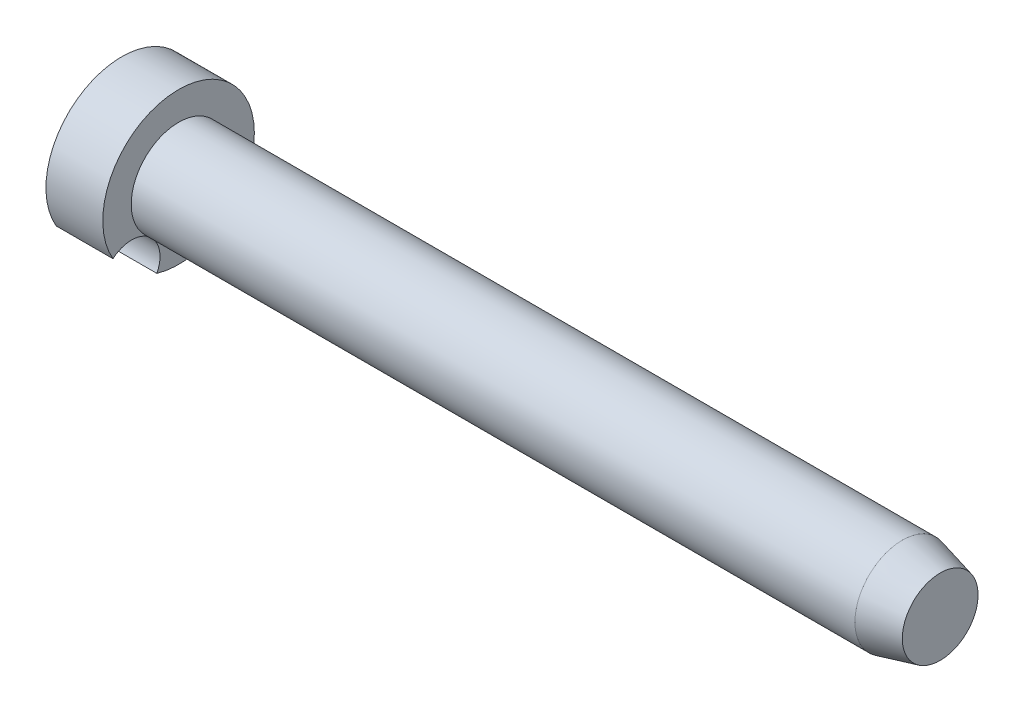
ISO-10303-21;
HEADER;
FILE_DESCRIPTION(('STEP AP214'),'2;1');
FILE_NAME('part.step','',(''),(''),'','','');
FILE_SCHEMA(('AUTOMOTIVE_DESIGN { 1 0 10303 214 1 1 1 1 }'));
ENDSEC;
DATA;
#1=APPLICATION_CONTEXT('core data for automotive mechanical design processes');
#2=APPLICATION_PROTOCOL_DEFINITION('international standard','automotive_design',2000,#1);
#3=PRODUCT_CONTEXT('',#1,'mechanical');
#4=PRODUCT('Part','Part','',(#3));
#5=PRODUCT_RELATED_PRODUCT_CATEGORY('part','',(#4));
#6=PRODUCT_DEFINITION_FORMATION('','',#4);
#7=PRODUCT_DEFINITION_CONTEXT('part definition',#1,'design');
#8=PRODUCT_DEFINITION('design','',#6,#7);
#9=PRODUCT_DEFINITION_SHAPE('','',#8);
#10=(LENGTH_UNIT() NAMED_UNIT(*) SI_UNIT(.MILLI.,.METRE.));
#11=(NAMED_UNIT(*) PLANE_ANGLE_UNIT() SI_UNIT($,.RADIAN.));
#12=(NAMED_UNIT(*) SI_UNIT($,.STERADIAN.) SOLID_ANGLE_UNIT());
#13=UNCERTAINTY_MEASURE_WITH_UNIT(LENGTH_MEASURE(1.E-05),#10,'distance_accuracy_value','');
#14=(GEOMETRIC_REPRESENTATION_CONTEXT(3) GLOBAL_UNCERTAINTY_ASSIGNED_CONTEXT((#13)) GLOBAL_UNIT_ASSIGNED_CONTEXT((#10,
#11,#12)) REPRESENTATION_CONTEXT('',''));
#15=CARTESIAN_POINT('',(0.,0.,0.));
#16=DIRECTION('',(0.,0.,1.));
#17=DIRECTION('',(1.,0.,0.));
#18=AXIS2_PLACEMENT_3D('',#15,#16,#17);
#19=CARTESIAN_POINT('',(0.,2.,0.));
#20=DIRECTION('',(-1.,0.,0.));
#21=DIRECTION('',(0.,0.,1.));
#22=AXIS2_PLACEMENT_3D('',#19,#20,#21);
#23=PLANE('',#22);
#24=CARTESIAN_POINT('',(0.,-1.89573427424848,-3.52224240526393));
#25=DIRECTION('',(1.,0.,0.));
#26=DIRECTION('',(0.,0.,-1.));
#27=AXIS2_PLACEMENT_3D('',#24,#25,#26);
#28=CIRCLE('',#27,1.5);
#29=CARTESIAN_POINT('',(0.,-0.465025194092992,-3.97287698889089));
#30=VERTEX_POINT('',#29);
#31=CARTESIAN_POINT('',(0.,-3.05985572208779,-2.57629248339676));
#32=VERTEX_POINT('',#31);
#33=EDGE_CURVE('E57',#30,#32,#28,.T.);
#34=ORIENTED_EDGE('',*,*,#33,.T.);
#35=CARTESIAN_POINT('',(0.,0.,0.));
#36=DIRECTION('',(1.,0.,0.));
#37=DIRECTION('',(0.,0.,-1.));
#38=AXIS2_PLACEMENT_3D('',#35,#36,#37);
#39=CIRCLE('',#38,4.);
#40=CARTESIAN_POINT('',(0.,-3.8317692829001,1.14784326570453));
#41=VERTEX_POINT('',#40);
#42=EDGE_CURVE('E79',#41,#32,#39,.T.);
#43=ORIENTED_EDGE('',*,*,#42,.F.);
#44=CARTESIAN_POINT('',(0.,-3.13954082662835,2.47856478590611));
#45=DIRECTION('',(1.,0.,0.));
#46=DIRECTION('',(0.,0.,-1.));
#47=AXIS2_PLACEMENT_3D('',#44,#45,#46);
#48=CIRCLE('',#47,1.5);
#49=CARTESIAN_POINT('',(0.,-2.00581444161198,3.46073813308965));
#50=VERTEX_POINT('',#49);
#51=EDGE_CURVE('E59',#41,#50,#48,.T.);
#52=ORIENTED_EDGE('',*,*,#51,.T.);
#53=CARTESIAN_POINT('',(0.,0.,0.));
#54=DIRECTION('',(1.,0.,0.));
#55=DIRECTION('',(0.,0.,-1.));
#56=AXIS2_PLACEMENT_3D('',#53,#54,#55);
#57=CIRCLE('',#56,4.);
#58=EDGE_CURVE('E20',#30,#50,#57,.T.);
#59=ORIENTED_EDGE('',*,*,#58,.F.);
#60=EDGE_LOOP('',(#34,#43,#52,#59));
#61=FACE_BOUND('',#60,.T.);
#62=ADVANCED_FACE('F17',(#61),#23,.T.);
#63=CARTESIAN_POINT('',(1.5,0.,0.));
#64=DIRECTION('',(1.,0.,0.));
#65=DIRECTION('',(0.,0.,-1.));
#66=AXIS2_PLACEMENT_3D('',#63,#64,#65);
#67=CYLINDRICAL_SURFACE('',#66,4.);
#68=DIRECTION('',(1.,0.,0.));
#69=VECTOR('',#68,1.);
#70=CARTESIAN_POINT('',(0.,-0.465025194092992,-3.97287698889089));
#71=LINE('',#70,#69);
#72=CARTESIAN_POINT('',(3.,-0.465025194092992,-3.97287698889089));
#73=VERTEX_POINT('',#72);
#74=EDGE_CURVE('E65',#73,#30,#71,.F.);
#75=ORIENTED_EDGE('',*,*,#74,.T.);
#76=ORIENTED_EDGE('',*,*,#58,.T.);
#77=DIRECTION('',(1.,0.,0.));
#78=VECTOR('',#77,1.);
#79=CARTESIAN_POINT('',(0.,-2.00581444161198,3.46073813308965));
#80=LINE('',#79,#78);
#81=CARTESIAN_POINT('',(3.,-2.00581444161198,3.46073813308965));
#82=VERTEX_POINT('',#81);
#83=EDGE_CURVE('E86',#50,#82,#80,.T.);
#84=ORIENTED_EDGE('',*,*,#83,.T.);
#85=CARTESIAN_POINT('',(3.,0.,0.));
#86=DIRECTION('',(1.,0.,0.));
#87=DIRECTION('',(0.,0.,-1.));
#88=AXIS2_PLACEMENT_3D('',#85,#86,#87);
#89=CIRCLE('',#88,4.);
#90=EDGE_CURVE('E69',#73,#82,#89,.T.);
#91=ORIENTED_EDGE('',*,*,#90,.F.);
#92=EDGE_LOOP('',(#75,#76,#84,#91));
#93=FACE_BOUND('',#92,.T.);
#94=ADVANCED_FACE('F66',(#93),#67,.T.);
#95=CARTESIAN_POINT('',(0.,-3.13954082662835,2.47856478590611));
#96=DIRECTION('',(1.,0.,0.));
#97=DIRECTION('',(0.,0.,-1.));
#98=AXIS2_PLACEMENT_3D('',#95,#96,#97);
#99=CYLINDRICAL_SURFACE('',#98,1.5);
#100=ORIENTED_EDGE('',*,*,#51,.F.);
#101=DIRECTION('',(1.,0.,0.));
#102=VECTOR('',#101,1.);
#103=CARTESIAN_POINT('',(1.5,-3.8317692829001,1.14784326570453));
#104=LINE('',#103,#102);
#105=CARTESIAN_POINT('',(3.,-3.8317692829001,1.14784326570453));
#106=VERTEX_POINT('',#105);
#107=EDGE_CURVE('E82',#106,#41,#104,.F.);
#108=ORIENTED_EDGE('',*,*,#107,.F.);
#109=CARTESIAN_POINT('',(3.,-3.13954082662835,2.47856478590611));
#110=DIRECTION('',(1.,0.,0.));
#111=DIRECTION('',(0.,0.,-1.));
#112=AXIS2_PLACEMENT_3D('',#109,#110,#111);
#113=CIRCLE('',#112,1.5);
#114=CARTESIAN_POINT('',(3.,-1.96221301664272,1.54910299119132));
#115=VERTEX_POINT('',#114);
#116=EDGE_CURVE('E35',#115,#106,#113,.F.);
#117=ORIENTED_EDGE('',*,*,#116,.F.);
#118=CARTESIAN_POINT('',(3.,-3.13954082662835,2.47856478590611));
#119=DIRECTION('',(1.,0.,0.));
#120=DIRECTION('',(0.,0.,-1.));
#121=AXIS2_PLACEMENT_3D('',#118,#119,#120);
#122=CIRCLE('',#121,1.5);
#123=EDGE_CURVE('E72',#82,#115,#122,.F.);
#124=ORIENTED_EDGE('',*,*,#123,.F.);
#125=ORIENTED_EDGE('',*,*,#83,.F.);
#126=EDGE_LOOP('',(#100,#108,#117,#124,#125));
#127=FACE_BOUND('',#126,.T.);
#128=ADVANCED_FACE('F140',(#127),#99,.F.);
#129=CARTESIAN_POINT('',(1.5,0.,0.));
#130=DIRECTION('',(1.,0.,0.));
#131=DIRECTION('',(0.,0.,-1.));
#132=AXIS2_PLACEMENT_3D('',#129,#130,#131);
#133=CYLINDRICAL_SURFACE('',#132,4.);
#134=DIRECTION('',(1.,0.,0.));
#135=VECTOR('',#134,1.);
#136=CARTESIAN_POINT('',(0.,-3.05985572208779,-2.57629248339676));
#137=LINE('',#136,#135);
#138=CARTESIAN_POINT('',(3.,-3.05985572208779,-2.57629248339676));
#139=VERTEX_POINT('',#138);
#140=EDGE_CURVE('E73',#32,#139,#137,.T.);
#141=ORIENTED_EDGE('',*,*,#140,.T.);
#142=CARTESIAN_POINT('',(3.,0.,0.));
#143=DIRECTION('',(1.,0.,0.));
#144=DIRECTION('',(0.,0.,-1.));
#145=AXIS2_PLACEMENT_3D('',#142,#143,#144);
#146=CIRCLE('',#145,4.);
#147=EDGE_CURVE('E102',#106,#139,#146,.T.);
#148=ORIENTED_EDGE('',*,*,#147,.F.);
#149=ORIENTED_EDGE('',*,*,#107,.T.);
#150=ORIENTED_EDGE('',*,*,#42,.T.);
#151=EDGE_LOOP('',(#141,#148,#149,#150));
#152=FACE_BOUND('',#151,.T.);
#153=ADVANCED_FACE('F137',(#152),#133,.T.);
#154=CARTESIAN_POINT('',(0.,-1.89573427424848,-3.52224240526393));
#155=DIRECTION('',(1.,0.,0.));
#156=DIRECTION('',(0.,0.,-1.));
#157=AXIS2_PLACEMENT_3D('',#154,#155,#156);
#158=CYLINDRICAL_SURFACE('',#157,1.5);
#159=CARTESIAN_POINT('',(3.,-1.89573427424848,-3.52224240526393));
#160=DIRECTION('',(1.,0.,0.));
#161=DIRECTION('',(0.,0.,-1.));
#162=AXIS2_PLACEMENT_3D('',#159,#160,#161);
#163=CIRCLE('',#162,1.5);
#164=CARTESIAN_POINT('',(3.,-1.1848339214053,-2.20140150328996));
#165=VERTEX_POINT('',#164);
#166=EDGE_CURVE('E106',#165,#73,#163,.F.);
#167=ORIENTED_EDGE('',*,*,#166,.F.);
#168=CARTESIAN_POINT('',(3.,-1.89573427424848,-3.52224240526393));
#169=DIRECTION('',(1.,0.,0.));
#170=DIRECTION('',(0.,0.,-1.));
#171=AXIS2_PLACEMENT_3D('',#168,#169,#170);
#172=CIRCLE('',#171,1.5);
#173=EDGE_CURVE('E99',#139,#165,#172,.F.);
#174=ORIENTED_EDGE('',*,*,#173,.F.);
#175=ORIENTED_EDGE('',*,*,#140,.F.);
#176=ORIENTED_EDGE('',*,*,#33,.F.);
#177=ORIENTED_EDGE('',*,*,#74,.F.);
#178=EDGE_LOOP('',(#167,#174,#175,#176,#177));
#179=FACE_BOUND('',#178,.T.);
#180=ADVANCED_FACE('F76',(#179),#158,.F.);
#181=CARTESIAN_POINT('',(43.2,1.25,0.));
#182=DIRECTION('',(1.,0.,0.));
#183=DIRECTION('',(0.,0.,-1.));
#184=AXIS2_PLACEMENT_3D('',#181,#182,#183);
#185=PLANE('',#184);
#186=CARTESIAN_POINT('',(43.2000000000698,0.,0.));
#187=DIRECTION('',(-1.,0.,0.));
#188=DIRECTION('',(0.,0.,1.));
#189=AXIS2_PLACEMENT_3D('',#186,#187,#188);
#190=CIRCLE('',#189,2.00000000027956);
#191=CARTESIAN_POINT('',(43.2000000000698,0.,2.00000000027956));
#192=VERTEX_POINT('',#191);
#193=EDGE_CURVE('E96',#192,#192,#190,.T.);
#194=ORIENTED_EDGE('',*,*,#193,.F.);
#195=EDGE_LOOP('',(#194));
#196=FACE_BOUND('',#195,.T.);
#197=ADVANCED_FACE('F131',(#196),#185,.T.);
#198=CARTESIAN_POINT('',(3.,3.25,0.));
#199=DIRECTION('',(1.,0.,0.));
#200=DIRECTION('',(0.,0.,-1.));
#201=AXIS2_PLACEMENT_3D('',#198,#199,#200);
#202=PLANE('',#201);
#203=ORIENTED_EDGE('',*,*,#166,.T.);
#204=ORIENTED_EDGE('',*,*,#90,.T.);
#205=ORIENTED_EDGE('',*,*,#123,.T.);
#206=CARTESIAN_POINT('',(3.,0.,0.));
#207=DIRECTION('',(1.,0.,0.));
#208=DIRECTION('',(0.,0.,-1.));
#209=AXIS2_PLACEMENT_3D('',#206,#207,#208);
#210=CIRCLE('',#209,2.5);
#211=EDGE_CURVE('E93',#165,#115,#210,.T.);
#212=ORIENTED_EDGE('',*,*,#211,.F.);
#213=EDGE_LOOP('',(#203,#204,#205,#212));
#214=FACE_BOUND('',#213,.T.);
#215=ADVANCED_FACE('F110',(#214),#202,.T.);
#216=CARTESIAN_POINT('',(3.,3.25,0.));
#217=DIRECTION('',(1.,0.,0.));
#218=DIRECTION('',(0.,0.,-1.));
#219=AXIS2_PLACEMENT_3D('',#216,#217,#218);
#220=PLANE('',#219);
#221=ORIENTED_EDGE('',*,*,#173,.T.);
#222=CARTESIAN_POINT('',(3.,0.,0.));
#223=DIRECTION('',(1.,0.,0.));
#224=DIRECTION('',(0.,0.,-1.));
#225=AXIS2_PLACEMENT_3D('',#222,#223,#224);
#226=CIRCLE('',#225,2.5);
#227=EDGE_CURVE('E26',#115,#165,#226,.T.);
#228=ORIENTED_EDGE('',*,*,#227,.F.);
#229=ORIENTED_EDGE('',*,*,#116,.T.);
#230=ORIENTED_EDGE('',*,*,#147,.T.);
#231=EDGE_LOOP('',(#221,#228,#229,#230));
#232=FACE_BOUND('',#231,.T.);
#233=ADVANCED_FACE('F112',(#232),#220,.T.);
#234=CARTESIAN_POINT('',(41.1999999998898,0.,0.));
#235=DIRECTION('',(-1.,0.,0.));
#236=DIRECTION('',(0.,0.,1.));
#237=AXIS2_PLACEMENT_3D('',#234,#235,#236);
#238=CONICAL_SURFACE('',#237,2.49999999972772,0.244978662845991);
#239=ORIENTED_EDGE('',*,*,#193,.T.);
#240=EDGE_LOOP('',(#239));
#241=FACE_BOUND('',#240,.T.);
#242=CARTESIAN_POINT('',(41.2,0.,0.));
#243=DIRECTION('',(1.,0.,0.));
#244=DIRECTION('',(0.,0.,-1.));
#245=AXIS2_PLACEMENT_3D('',#242,#243,#244);
#246=CIRCLE('',#245,2.5);
#247=CARTESIAN_POINT('',(41.2,0.,-2.5));
#248=VERTEX_POINT('',#247);
#249=EDGE_CURVE('E11',#248,#248,#246,.F.);
#250=ORIENTED_EDGE('',*,*,#249,.F.);
#251=EDGE_LOOP('',(#250));
#252=FACE_BOUND('',#251,.T.);
#253=ADVANCED_FACE('F117',(#241,#252),#238,.T.);
#254=CARTESIAN_POINT('',(23.1,0.,0.));
#255=DIRECTION('',(1.,0.,0.));
#256=DIRECTION('',(0.,0.,-1.));
#257=AXIS2_PLACEMENT_3D('',#254,#255,#256);
#258=CYLINDRICAL_SURFACE('',#257,2.5);
#259=ORIENTED_EDGE('',*,*,#249,.T.);
#260=EDGE_LOOP('',(#259));
#261=FACE_BOUND('',#260,.T.);
#262=ORIENTED_EDGE('',*,*,#211,.T.);
#263=ORIENTED_EDGE('',*,*,#227,.T.);
#264=EDGE_LOOP('',(#262,#263));
#265=FACE_BOUND('',#264,.T.);
#266=ADVANCED_FACE('F115',(#261,#265),#258,.T.);
#267=CLOSED_SHELL('',(#62,#94,#128,#153,#180,#197,#215,#233,#253,#266));
#268=MANIFOLD_SOLID_BREP('B1',#267);
#269=ADVANCED_BREP_SHAPE_REPRESENTATION('',(#18,#268),#14);
#270=SHAPE_DEFINITION_REPRESENTATION(#9,#269);
ENDSEC;
END-ISO-10303-21;
